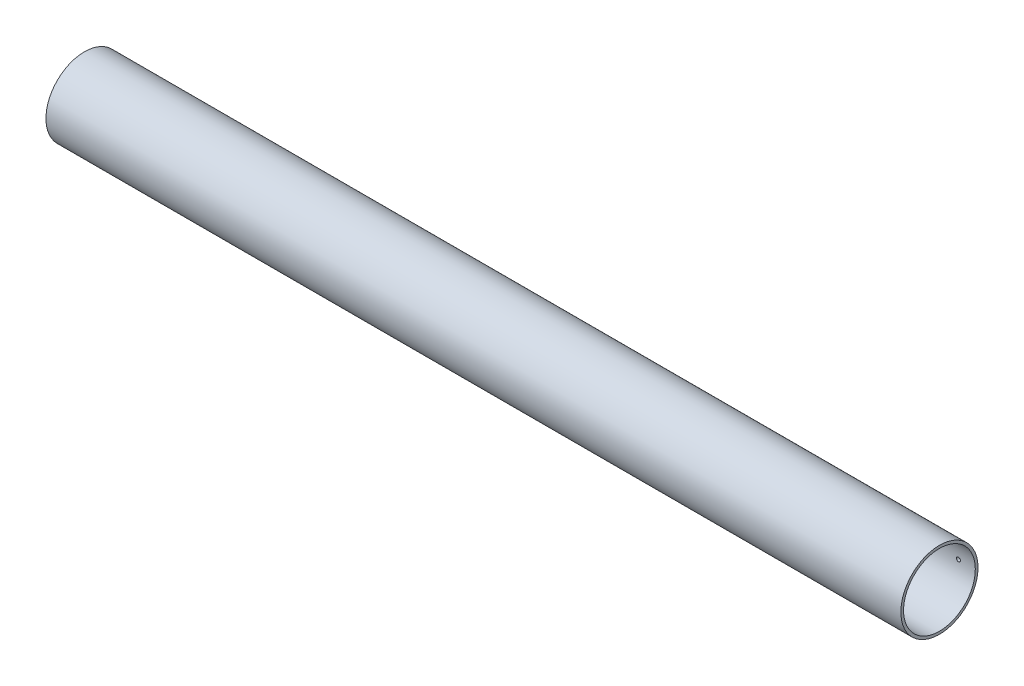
ISO-10303-21;
HEADER;
FILE_DESCRIPTION(('STEP AP214'),'2;1');
FILE_NAME('part.step','',(''),(''),'','','');
FILE_SCHEMA(('AUTOMOTIVE_DESIGN { 1 0 10303 214 1 1 1 1 }'));
ENDSEC;
DATA;
#1=APPLICATION_CONTEXT('core data for automotive mechanical design processes');
#2=APPLICATION_PROTOCOL_DEFINITION('international standard','automotive_design',2000,#1);
#3=PRODUCT_CONTEXT('',#1,'mechanical');
#4=PRODUCT('Part','Part','',(#3));
#5=PRODUCT_RELATED_PRODUCT_CATEGORY('part','',(#4));
#6=PRODUCT_DEFINITION_FORMATION('','',#4);
#7=PRODUCT_DEFINITION_CONTEXT('part definition',#1,'design');
#8=PRODUCT_DEFINITION('design','',#6,#7);
#9=PRODUCT_DEFINITION_SHAPE('','',#8);
#10=(LENGTH_UNIT() NAMED_UNIT(*) SI_UNIT(.MILLI.,.METRE.));
#11=(NAMED_UNIT(*) PLANE_ANGLE_UNIT() SI_UNIT($,.RADIAN.));
#12=(NAMED_UNIT(*) SI_UNIT($,.STERADIAN.) SOLID_ANGLE_UNIT());
#13=UNCERTAINTY_MEASURE_WITH_UNIT(LENGTH_MEASURE(1.E-05),#10,'distance_accuracy_value','');
#14=(GEOMETRIC_REPRESENTATION_CONTEXT(3) GLOBAL_UNCERTAINTY_ASSIGNED_CONTEXT((#13)) GLOBAL_UNIT_ASSIGNED_CONTEXT((#10,
#11,#12)) REPRESENTATION_CONTEXT('',''));
#15=CARTESIAN_POINT('',(0.,0.,0.));
#16=DIRECTION('',(0.,0.,1.));
#17=DIRECTION('',(1.,0.,0.));
#18=AXIS2_PLACEMENT_3D('',#15,#16,#17);
#19=CARTESIAN_POINT('',(644.525,0.,0.));
#20=DIRECTION('',(1.,0.,0.));
#21=DIRECTION('',(0.,0.,-1.));
#22=AXIS2_PLACEMENT_3D('',#19,#20,#21);
#23=PLANE('',#22);
#24=CARTESIAN_POINT('',(644.525,0.,0.));
#25=DIRECTION('',(1.,0.,0.));
#26=DIRECTION('',(0.,0.,-1.));
#27=AXIS2_PLACEMENT_3D('',#24,#25,#26);
#28=CIRCLE('',#27,29.083);
#29=CARTESIAN_POINT('',(644.525,0.,-29.083));
#30=VERTEX_POINT('',#29);
#31=EDGE_CURVE('E10',#30,#30,#28,.T.);
#32=ORIENTED_EDGE('',*,*,#31,.T.);
#33=EDGE_LOOP('',(#32));
#34=FACE_BOUND('',#33,.T.);
#35=CARTESIAN_POINT('',(644.525,0.,0.));
#36=DIRECTION('',(1.,0.,0.));
#37=DIRECTION('',(0.,0.,-1.));
#38=AXIS2_PLACEMENT_3D('',#35,#36,#37);
#39=CIRCLE('',#38,27.051);
#40=CARTESIAN_POINT('',(644.525,0.,-27.051));
#41=VERTEX_POINT('',#40);
#42=EDGE_CURVE('E47',#41,#41,#39,.T.);
#43=ORIENTED_EDGE('',*,*,#42,.F.);
#44=EDGE_LOOP('',(#43));
#45=FACE_BOUND('',#44,.T.);
#46=ADVANCED_FACE('F29',(#34,#45),#23,.T.);
#47=CARTESIAN_POINT('',(0.,0.,0.));
#48=DIRECTION('',(1.,0.,0.));
#49=DIRECTION('',(0.,0.,-1.));
#50=AXIS2_PLACEMENT_3D('',#47,#48,#49);
#51=PLANE('',#50);
#52=CARTESIAN_POINT('',(0.,0.,0.));
#53=DIRECTION('',(1.,0.,0.));
#54=DIRECTION('',(0.,0.,-1.));
#55=AXIS2_PLACEMENT_3D('',#52,#53,#54);
#56=CIRCLE('',#55,29.083);
#57=CARTESIAN_POINT('',(0.,0.,-29.083));
#58=VERTEX_POINT('',#57);
#59=EDGE_CURVE('E42',#58,#58,#56,.T.);
#60=ORIENTED_EDGE('',*,*,#59,.F.);
#61=EDGE_LOOP('',(#60));
#62=FACE_BOUND('',#61,.T.);
#63=CARTESIAN_POINT('',(0.,0.,0.));
#64=DIRECTION('',(1.,0.,0.));
#65=DIRECTION('',(0.,0.,-1.));
#66=AXIS2_PLACEMENT_3D('',#63,#64,#65);
#67=CIRCLE('',#66,27.051);
#68=CARTESIAN_POINT('',(0.,0.,-27.051));
#69=VERTEX_POINT('',#68);
#70=EDGE_CURVE('E73',#69,#69,#67,.T.);
#71=ORIENTED_EDGE('',*,*,#70,.T.);
#72=EDGE_LOOP('',(#71));
#73=FACE_BOUND('',#72,.T.);
#74=ADVANCED_FACE('F83',(#62,#73),#51,.F.);
#75=CARTESIAN_POINT('',(644.525,0.,0.));
#76=DIRECTION('',(-1.,0.,0.));
#77=DIRECTION('',(0.,0.,1.));
#78=AXIS2_PLACEMENT_3D('',#75,#76,#77);
#79=CYLINDRICAL_SURFACE('',#78,29.083);
#80=CARTESIAN_POINT('',(633.349,0.,-29.083));
#81=CARTESIAN_POINT('',(633.34899622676,0.0855407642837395,-29.082999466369));
#82=CARTESIAN_POINT('',(633.341773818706,0.171142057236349,-29.082618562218));
#83=CARTESIAN_POINT('',(633.313064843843,0.339982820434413,-29.0811356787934));
#84=CARTESIAN_POINT('',(633.291561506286,0.423219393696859,-29.0800328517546));
#85=CARTESIAN_POINT('',(633.23490837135,0.58486048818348,-29.0772309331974));
#86=CARTESIAN_POINT('',(633.19976557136,0.663267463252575,-29.0755321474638));
#87=CARTESIAN_POINT('',(633.116841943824,0.813048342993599,-29.0717295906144));
#88=CARTESIAN_POINT('',(633.069064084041,0.884423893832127,-29.069625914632));
#89=CARTESIAN_POINT('',(632.962168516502,1.01821514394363,-29.0652476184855));
#90=CARTESIAN_POINT('',(632.903039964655,1.08062217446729,-29.0629728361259));
#91=CARTESIAN_POINT('',(632.775143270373,1.19463094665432,-29.0585101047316));
#92=CARTESIAN_POINT('',(632.706374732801,1.24623224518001,-29.056322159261));
#93=CARTESIAN_POINT('',(632.561103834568,1.33718933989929,-29.0522786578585));
#94=CARTESIAN_POINT('',(632.484597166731,1.37653826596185,-29.0504232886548));
#95=CARTESIAN_POINT('',(632.326052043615,1.44182959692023,-29.0472561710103));
#96=CARTESIAN_POINT('',(632.244013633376,1.46777211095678,-29.045944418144));
#97=CARTESIAN_POINT('',(632.07681443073,1.50549103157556,-29.0440139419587));
#98=CARTESIAN_POINT('',(631.99165660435,1.51728055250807,-29.0433945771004));
#99=CARTESIAN_POINT('',(631.820568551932,1.52639929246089,-29.0429167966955));
#100=CARTESIAN_POINT('',(631.734638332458,1.52372863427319,-29.0430583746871));
#101=CARTESIAN_POINT('',(631.564533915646,1.50401374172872,-29.0440859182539));
#102=CARTESIAN_POINT('',(631.480358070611,1.48698368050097,-29.0449711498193));
#103=CARTESIAN_POINT('',(631.316061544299,1.43905537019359,-29.0473850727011));
#104=CARTESIAN_POINT('',(631.235940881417,1.40815705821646,-29.0489137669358));
#105=CARTESIAN_POINT('',(631.081983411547,1.33335316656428,-29.0524431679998));
#106=CARTESIAN_POINT('',(631.008149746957,1.28944113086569,-29.0544441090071));
#107=CARTESIAN_POINT('',(630.868896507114,1.18986099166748,-29.058692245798));
#108=CARTESIAN_POINT('',(630.803476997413,1.13419279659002,-29.0609394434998));
#109=CARTESIAN_POINT('',(630.682826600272,1.01260060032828,-29.0654300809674));
#110=CARTESIAN_POINT('',(630.627608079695,0.946664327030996,-29.0676735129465));
#111=CARTESIAN_POINT('',(630.529022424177,0.806450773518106,-29.0719011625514));
#112=CARTESIAN_POINT('',(630.485655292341,0.732173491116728,-29.0738853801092));
#113=CARTESIAN_POINT('',(630.412004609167,0.577379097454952,-29.0773710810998));
#114=CARTESIAN_POINT('',(630.381721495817,0.496861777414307,-29.078872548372));
#115=CARTESIAN_POINT('',(630.335106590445,0.331876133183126,-29.0812233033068));
#116=CARTESIAN_POINT('',(630.318774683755,0.247407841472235,-29.0820725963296));
#117=CARTESIAN_POINT('',(630.300541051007,0.0770253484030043,-29.083022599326));
#118=CARTESIAN_POINT('',(630.298622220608,-0.00888701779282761,-29.083124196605));
#119=CARTESIAN_POINT('',(630.309224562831,-0.179813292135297,-29.0825697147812));
#120=CARTESIAN_POINT('',(630.321745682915,-0.264827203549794,-29.0819136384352));
#121=CARTESIAN_POINT('',(630.360858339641,-0.431495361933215,-29.0799182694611));
#122=CARTESIAN_POINT('',(630.387442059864,-0.513151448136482,-29.0785793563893));
#123=CARTESIAN_POINT('',(630.453917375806,-0.67084271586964,-29.0753690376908));
#124=CARTESIAN_POINT('',(630.493809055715,-0.746877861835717,-29.0734976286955));
#125=CARTESIAN_POINT('',(630.585811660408,-0.891247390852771,-29.0694305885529));
#126=CARTESIAN_POINT('',(630.637934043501,-0.959574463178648,-29.0672346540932));
#127=CARTESIAN_POINT('',(630.752901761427,-1.08651476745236,-29.0627668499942));
#128=CARTESIAN_POINT('',(630.815747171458,-1.14512793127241,-29.0604949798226));
#129=CARTESIAN_POINT('',(630.950450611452,-1.25103425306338,-29.056128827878));
#130=CARTESIAN_POINT('',(631.022317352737,-1.2983163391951,-29.054034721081));
#131=CARTESIAN_POINT('',(631.172979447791,-1.38014265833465,-29.050262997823));
#132=CARTESIAN_POINT('',(631.251774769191,-1.41468695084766,-29.0485853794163));
#133=CARTESIAN_POINT('',(631.414016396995,-1.47003781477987,-29.0458370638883));
#134=CARTESIAN_POINT('',(631.497460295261,-1.49085142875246,-29.0447660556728));
#135=CARTESIAN_POINT('',(631.666664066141,-1.51817314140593,-29.0433508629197));
#136=CARTESIAN_POINT('',(631.752423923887,-1.52468133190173,-29.0430066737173));
#137=CARTESIAN_POINT('',(631.923715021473,-1.5232065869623,-29.043084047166));
#138=CARTESIAN_POINT('',(632.009246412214,-1.51524106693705,-29.0435046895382));
#139=CARTESIAN_POINT('',(632.177755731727,-1.48508103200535,-29.045062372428));
#140=CARTESIAN_POINT('',(632.260733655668,-1.462886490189,-29.0461994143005));
#141=CARTESIAN_POINT('',(632.421784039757,-1.40490206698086,-29.0490615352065));
#142=CARTESIAN_POINT('',(632.499856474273,-1.36911211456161,-29.0507866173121));
#143=CARTESIAN_POINT('',(632.648885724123,-1.28495567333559,-29.0546303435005));
#144=CARTESIAN_POINT('',(632.719842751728,-1.2365895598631,-29.0567489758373));
#145=CARTESIAN_POINT('',(632.852714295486,-1.12859085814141,-29.0611439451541));
#146=CARTESIAN_POINT('',(632.914618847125,-1.06894601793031,-29.0634204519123));
#147=CARTESIAN_POINT('',(633.027556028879,-0.940093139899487,-29.0678733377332));
#148=CARTESIAN_POINT('',(633.078585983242,-0.870882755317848,-29.0700496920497));
#149=CARTESIAN_POINT('',(633.168351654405,-0.724804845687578,-29.0740586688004));
#150=CARTESIAN_POINT('',(633.207074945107,-0.647929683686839,-29.0758909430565));
#151=CARTESIAN_POINT('',(633.271018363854,-0.488816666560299,-29.0790001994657));
#152=CARTESIAN_POINT('',(633.296254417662,-0.406585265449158,-29.0802778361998));
#153=CARTESIAN_POINT('',(633.325898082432,-0.26987025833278,-29.0817964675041));
#154=CARTESIAN_POINT('',(633.334550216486,-0.216271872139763,-29.0822458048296));
#155=CARTESIAN_POINT('',(633.346102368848,-0.108457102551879,-29.0828477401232));
#156=CARTESIAN_POINT('',(633.349002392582,-0.0542407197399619,-29.0830003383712));
#157=CARTESIAN_POINT('',(633.349,0.,-29.083));
#158=B_SPLINE_CURVE_WITH_KNOTS('',3,(#80,#81,#82,#83,#84,#85,#86,#87,#88,#89,#90,#91,#92,#93,
#94,#95,#96,#97,#98,#99,#100,#101,#102,#103,#104,#105,#106,#107,#108,#109,#110,#111,#112,#113,
#114,#115,#116,#117,#118,#119,#120,#121,#122,#123,#124,#125,#126,#127,#128,#129,#130,#131,#132,
#133,#134,#135,#136,#137,#138,#139,#140,#141,#142,#143,#144,#145,#146,#147,#148,#149,#150,#151,
#152,#153,#154,#155,#156,#157),.UNSPECIFIED.,.T.,.F.,(4,2,2,2,2,2,2,2,2,2,2,2,2,2,2,2,2,2,2,2,2,
2,2,2,2,2,2,2,2,2,2,2,2,2,2,2,2,2,4),(0.,0.256424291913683,0.513150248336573,0.769744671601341,
1.02627887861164,1.28305940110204,1.53985045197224,1.79678523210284,2.05371792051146,
2.31041234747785,2.56710459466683,2.82354377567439,3.07998411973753,3.33655189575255,
3.59312167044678,3.8500004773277,4.1068793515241,4.36376682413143,4.62065218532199,
4.87723264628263,5.13381217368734,5.39024923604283,5.64668792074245,5.90336781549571,
6.16004951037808,6.41698100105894,6.67391129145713,6.93070969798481,7.18750645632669,
7.44399443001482,7.70048288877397,7.95697268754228,8.21345483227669,8.47021720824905,
8.72704268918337,8.9841266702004,9.24090641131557,9.40350317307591,9.56609978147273),.UNSPECIFIED.);
#159=CARTESIAN_POINT('',(633.349,0.,-29.083));
#160=VERTEX_POINT('',#159);
#161=EDGE_CURVE('E56',#160,#160,#158,.T.);
#162=ORIENTED_EDGE('',*,*,#161,.T.);
#163=EDGE_LOOP('',(#162));
#164=FACE_BOUND('',#163,.T.);
#165=CARTESIAN_POINT('',(11.684,0.,-29.083));
#166=CARTESIAN_POINT('',(11.6839962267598,0.0855407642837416,-29.082999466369));
#167=CARTESIAN_POINT('',(11.6767738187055,0.171142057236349,-29.082618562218));
#168=CARTESIAN_POINT('',(11.6480648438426,0.339982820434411,-29.0811356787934));
#169=CARTESIAN_POINT('',(11.6265615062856,0.423219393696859,-29.0800328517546));
#170=CARTESIAN_POINT('',(11.5699083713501,0.584860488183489,-29.0772309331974));
#171=CARTESIAN_POINT('',(11.5347655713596,0.663267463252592,-29.0755321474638));
#172=CARTESIAN_POINT('',(11.4518419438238,0.813048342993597,-29.0717295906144));
#173=CARTESIAN_POINT('',(11.404064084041,0.884423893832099,-29.069625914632));
#174=CARTESIAN_POINT('',(11.2971685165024,1.01821514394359,-29.0652476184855));
#175=CARTESIAN_POINT('',(11.238039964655,1.08062217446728,-29.0629728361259));
#176=CARTESIAN_POINT('',(11.1101432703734,1.19463094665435,-29.0585101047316));
#177=CARTESIAN_POINT('',(11.0413747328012,1.24623224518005,-29.056322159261));
#178=CARTESIAN_POINT('',(10.8961038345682,1.33718933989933,-29.0522786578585));
#179=CARTESIAN_POINT('',(10.8195971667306,1.37653826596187,-29.0504232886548));
#180=CARTESIAN_POINT('',(10.6610520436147,1.44182959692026,-29.0472561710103));
#181=CARTESIAN_POINT('',(10.5790136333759,1.46777211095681,-29.045944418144));
#182=CARTESIAN_POINT('',(10.41181443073,1.50549103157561,-29.0440139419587));
#183=CARTESIAN_POINT('',(10.3266566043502,1.51728055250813,-29.0433945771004));
#184=CARTESIAN_POINT('',(10.1555685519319,1.52639929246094,-29.0429167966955));
#185=CARTESIAN_POINT('',(10.0696383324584,1.52372863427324,-29.0430583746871));
#186=CARTESIAN_POINT('',(9.89953391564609,1.50401374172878,-29.0440859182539));
#187=CARTESIAN_POINT('',(9.81535807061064,1.48698368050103,-29.0449711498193));
#188=CARTESIAN_POINT('',(9.65106154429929,1.43905537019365,-29.047385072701));
#189=CARTESIAN_POINT('',(9.57094088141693,1.40815705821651,-29.0489137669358));
#190=CARTESIAN_POINT('',(9.41698341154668,1.33335316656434,-29.0524431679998));
#191=CARTESIAN_POINT('',(9.34314974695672,1.28944113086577,-29.0544441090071));
#192=CARTESIAN_POINT('',(9.20389650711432,1.18986099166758,-29.0586922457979));
#193=CARTESIAN_POINT('',(9.13847699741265,1.13419279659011,-29.0609394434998));
#194=CARTESIAN_POINT('',(9.01782660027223,1.01260060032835,-29.0654300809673));
#195=CARTESIAN_POINT('',(8.96260807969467,0.94666432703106,-29.0676735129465));
#196=CARTESIAN_POINT('',(8.86402242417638,0.806450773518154,-29.0719011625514));
#197=CARTESIAN_POINT('',(8.82065529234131,0.73217349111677,-29.0738853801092));
#198=CARTESIAN_POINT('',(8.74700460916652,0.577379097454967,-29.0773710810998));
#199=CARTESIAN_POINT('',(8.7167214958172,0.496861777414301,-29.078872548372));
#200=CARTESIAN_POINT('',(8.67010659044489,0.331876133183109,-29.0812233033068));
#201=CARTESIAN_POINT('',(8.65377468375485,0.247407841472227,-29.0820725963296));
#202=CARTESIAN_POINT('',(8.63554105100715,0.0770253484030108,-29.083022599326));
#203=CARTESIAN_POINT('',(8.63362222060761,-0.00888701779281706,-29.083124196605));
#204=CARTESIAN_POINT('',(8.64422456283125,-0.179813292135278,-29.0825697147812));
#205=CARTESIAN_POINT('',(8.65674568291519,-0.26482720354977,-29.0819136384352));
#206=CARTESIAN_POINT('',(8.69585833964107,-0.431495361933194,-29.0799182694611));
#207=CARTESIAN_POINT('',(8.72244205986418,-0.513151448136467,-29.0785793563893));
#208=CARTESIAN_POINT('',(8.78891737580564,-0.67084271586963,-29.0753690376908));
#209=CARTESIAN_POINT('',(8.82880905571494,-0.746877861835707,-29.0734976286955));
#210=CARTESIAN_POINT('',(8.92081166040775,-0.891247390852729,-29.0694305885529));
#211=CARTESIAN_POINT('',(8.9729340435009,-0.959574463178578,-29.0672346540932));
#212=CARTESIAN_POINT('',(9.08790176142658,-1.08651476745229,-29.0627668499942));
#213=CARTESIAN_POINT('',(9.150747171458,-1.14512793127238,-29.0604949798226));
#214=CARTESIAN_POINT('',(9.2854506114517,-1.25103425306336,-29.056128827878));
#215=CARTESIAN_POINT('',(9.3573173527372,-1.29831633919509,-29.054034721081));
#216=CARTESIAN_POINT('',(9.50797944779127,-1.38014265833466,-29.050262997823));
#217=CARTESIAN_POINT('',(9.58677476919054,-1.4146869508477,-29.0485853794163));
#218=CARTESIAN_POINT('',(9.74901639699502,-1.4700378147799,-29.0458370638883));
#219=CARTESIAN_POINT('',(9.83246029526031,-1.49085142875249,-29.0447660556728));
#220=CARTESIAN_POINT('',(10.0016640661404,-1.51817314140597,-29.0433508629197));
#221=CARTESIAN_POINT('',(10.0874239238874,-1.52468133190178,-29.0430066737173));
#222=CARTESIAN_POINT('',(10.258715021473,-1.52320658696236,-29.043084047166));
#223=CARTESIAN_POINT('',(10.3442464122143,-1.51524106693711,-29.0435046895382));
#224=CARTESIAN_POINT('',(10.5127557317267,-1.48508103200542,-29.045062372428));
#225=CARTESIAN_POINT('',(10.5957336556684,-1.46288649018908,-29.0461994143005));
#226=CARTESIAN_POINT('',(10.7567840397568,-1.40490206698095,-29.0490615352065));
#227=CARTESIAN_POINT('',(10.8348564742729,-1.3691121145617,-29.0507866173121));
#228=CARTESIAN_POINT('',(10.9838857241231,-1.2849556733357,-29.0546303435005));
#229=CARTESIAN_POINT('',(11.0548427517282,-1.23658955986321,-29.0567489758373));
#230=CARTESIAN_POINT('',(11.1877142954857,-1.12859085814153,-29.0611439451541));
#231=CARTESIAN_POINT('',(11.2496188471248,-1.06894601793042,-29.0634204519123));
#232=CARTESIAN_POINT('',(11.3625560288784,-0.940093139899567,-29.0678733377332));
#233=CARTESIAN_POINT('',(11.4135859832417,-0.8708827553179,-29.0700496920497));
#234=CARTESIAN_POINT('',(11.5033516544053,-0.724804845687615,-29.0740586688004));
#235=CARTESIAN_POINT('',(11.5420749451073,-0.647929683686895,-29.0758909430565));
#236=CARTESIAN_POINT('',(11.6060183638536,-0.488816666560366,-29.0790001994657));
#237=CARTESIAN_POINT('',(11.6312544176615,-0.406585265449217,-29.0802778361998));
#238=CARTESIAN_POINT('',(11.6608980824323,-0.26987025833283,-29.0817964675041));
#239=CARTESIAN_POINT('',(11.6695502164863,-0.216271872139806,-29.0822458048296));
#240=CARTESIAN_POINT('',(11.6811023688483,-0.108457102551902,-29.0828477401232));
#241=CARTESIAN_POINT('',(11.6840023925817,-0.0542407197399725,-29.0830003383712));
#242=CARTESIAN_POINT('',(11.684,0.,-29.083));
#243=B_SPLINE_CURVE_WITH_KNOTS('',3,(#165,#166,#167,#168,#169,#170,#171,#172,#173,#174,#175,
#176,#177,#178,#179,#180,#181,#182,#183,#184,#185,#186,#187,#188,#189,#190,#191,#192,#193,#194,
#195,#196,#197,#198,#199,#200,#201,#202,#203,#204,#205,#206,#207,#208,#209,#210,#211,#212,#213,
#214,#215,#216,#217,#218,#219,#220,#221,#222,#223,#224,#225,#226,#227,#228,#229,#230,#231,#232,
#233,#234,#235,#236,#237,#238,#239,#240,#241,#242),.UNSPECIFIED.,.T.,.F.,(4,2,2,2,2,2,2,2,2,2,2,
2,2,2,2,2,2,2,2,2,2,2,2,2,2,2,2,2,2,2,2,2,2,2,2,2,2,2,4),(0.,0.256424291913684,
0.513150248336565,0.769744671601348,1.02627887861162,1.28305940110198,1.53985045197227,
1.7967852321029,2.05371792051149,2.310412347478,2.56710459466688,2.82354377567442,
3.07998411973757,3.33655189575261,3.5931216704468,3.85000047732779,4.10687935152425,
4.3637668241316,4.62065218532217,4.87723264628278,5.13381217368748,5.390249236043,
5.64668792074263,5.90336781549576,6.16004951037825,6.41698100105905,6.67391129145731,
6.9307096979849,7.18750645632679,7.44399443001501,7.70048288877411,7.95697268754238,
8.21345483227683,8.47021720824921,8.72704268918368,8.98412667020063,9.2409064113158,
9.40350317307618,9.56609978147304),.UNSPECIFIED.);
#244=CARTESIAN_POINT('',(11.684,0.,-29.083));
#245=VERTEX_POINT('',#244);
#246=EDGE_CURVE('E55',#245,#245,#243,.T.);
#247=ORIENTED_EDGE('',*,*,#246,.T.);
#248=EDGE_LOOP('',(#247));
#249=FACE_BOUND('',#248,.T.);
#250=ORIENTED_EDGE('',*,*,#31,.F.);
#251=EDGE_LOOP('',(#250));
#252=FACE_BOUND('',#251,.T.);
#253=ORIENTED_EDGE('',*,*,#59,.T.);
#254=EDGE_LOOP('',(#253));
#255=FACE_BOUND('',#254,.T.);
#256=ADVANCED_FACE('F31',(#164,#249,#252,#255),#79,.T.);
#257=CARTESIAN_POINT('',(644.525,0.,0.));
#258=DIRECTION('',(-1.,0.,0.));
#259=DIRECTION('',(0.,0.,1.));
#260=AXIS2_PLACEMENT_3D('',#257,#258,#259);
#261=CYLINDRICAL_SURFACE('',#260,27.051);
#262=CARTESIAN_POINT('',(633.349,0.,-27.051));
#263=CARTESIAN_POINT('',(633.348996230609,0.0855309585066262,-27.0509994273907));
#264=CARTESIAN_POINT('',(633.341775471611,0.171122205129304,-27.0505900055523));
#265=CARTESIAN_POINT('',(633.313073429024,0.339942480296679,-27.0489961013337));
#266=CARTESIAN_POINT('',(633.291575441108,0.423168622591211,-27.0478107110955));
#267=CARTESIAN_POINT('',(633.23493734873,0.584788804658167,-27.0447990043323));
#268=CARTESIAN_POINT('',(633.1998043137,0.663185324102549,-27.0429730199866));
#269=CARTESIAN_POINT('',(633.116904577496,0.812947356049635,-27.0388856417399));
#270=CARTESIAN_POINT('',(633.069140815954,0.884314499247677,-27.0366243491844));
#271=CARTESIAN_POINT('',(632.962269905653,1.01810159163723,-27.0319174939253));
#272=CARTESIAN_POINT('',(632.903150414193,1.0805116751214,-27.0294717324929));
#273=CARTESIAN_POINT('',(632.775271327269,1.19452881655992,-27.0246732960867));
#274=CARTESIAN_POINT('',(632.706511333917,1.24613542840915,-27.02232062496));
#275=CARTESIAN_POINT('',(632.561248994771,1.33710972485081,-27.0179721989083));
#276=CARTESIAN_POINT('',(632.484741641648,1.37646942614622,-27.0159766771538));
#277=CARTESIAN_POINT('',(632.326191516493,1.44178148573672,-27.0125700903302));
#278=CARTESIAN_POINT('',(632.244148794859,1.46773396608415,-27.0111590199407));
#279=CARTESIAN_POINT('',(632.076950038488,1.50546807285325,-27.0090823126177));
#280=CARTESIAN_POINT('',(631.991797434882,1.51726485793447,-27.0084158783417));
#281=CARTESIAN_POINT('',(631.820718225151,1.52639948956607,-27.0079012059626));
#282=CARTESIAN_POINT('',(631.734791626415,1.52373747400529,-27.0080529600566));
#283=CARTESIAN_POINT('',(631.564706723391,1.50404267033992,-27.0091568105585));
#284=CARTESIAN_POINT('',(631.480546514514,1.48702627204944,-27.0101079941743));
#285=CARTESIAN_POINT('',(631.316278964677,1.43913114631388,-27.0127020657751));
#286=CARTESIAN_POINT('',(631.236171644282,1.40825234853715,-27.0143449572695));
#287=CARTESIAN_POINT('',(631.08223108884,1.33349029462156,-27.0181383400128));
#288=CARTESIAN_POINT('',(631.008401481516,1.28959958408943,-27.020289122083));
#289=CARTESIAN_POINT('',(630.869151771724,1.19006501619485,-27.0248555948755));
#290=CARTESIAN_POINT('',(630.803731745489,1.13442105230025,-27.0272712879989));
#291=CARTESIAN_POINT('',(630.683062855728,1.01286710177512,-27.0320993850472));
#292=CARTESIAN_POINT('',(630.627828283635,0.946942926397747,-27.0345117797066));
#293=CARTESIAN_POINT('',(630.529208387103,0.80674970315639,-27.039058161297));
#294=CARTESIAN_POINT('',(630.485823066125,0.73248065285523,-27.0411921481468));
#295=CARTESIAN_POINT('',(630.412134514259,0.577697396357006,-27.0449413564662));
#296=CARTESIAN_POINT('',(630.381831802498,0.497182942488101,-27.0465565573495));
#297=CARTESIAN_POINT('',(630.335178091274,0.332198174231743,-27.0490858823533));
#298=CARTESIAN_POINT('',(630.318826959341,0.247727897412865,-27.0500000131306));
#299=CARTESIAN_POINT('',(630.300558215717,0.0773533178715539,-27.0510233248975));
#300=CARTESIAN_POINT('',(630.298620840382,-0.00854885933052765,-27.0511336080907));
#301=CARTESIAN_POINT('',(630.309182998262,-0.179457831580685,-27.0505397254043));
#302=CARTESIAN_POINT('',(630.321682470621,-0.264464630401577,-27.0498355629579));
#303=CARTESIAN_POINT('',(630.360747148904,-0.43111429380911,-27.0476927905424));
#304=CARTESIAN_POINT('',(630.387303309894,-0.512759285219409,-27.0462546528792));
#305=CARTESIAN_POINT('',(630.45371835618,-0.670433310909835,-27.0428057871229));
#306=CARTESIAN_POINT('',(630.493577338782,-0.746462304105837,-27.0407950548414));
#307=CARTESIAN_POINT('',(630.585517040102,-0.8908367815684,-27.036424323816));
#308=CARTESIAN_POINT('',(630.637610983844,-0.959173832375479,-27.0340639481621));
#309=CARTESIAN_POINT('',(630.752522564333,-1.0861397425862,-27.0292609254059));
#310=CARTESIAN_POINT('',(630.815340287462,-1.14476852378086,-27.026818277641));
#311=CARTESIAN_POINT('',(630.950001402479,-1.25072037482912,-27.0221228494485));
#312=CARTESIAN_POINT('',(631.021854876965,-1.29803064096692,-27.0198702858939));
#313=CARTESIAN_POINT('',(631.172497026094,-1.37991495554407,-27.0158124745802));
#314=CARTESIAN_POINT('',(631.251285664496,-1.41448907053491,-27.0140072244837));
#315=CARTESIAN_POINT('',(631.413514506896,-1.46989739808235,-27.0110491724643));
#316=CARTESIAN_POINT('',(631.4969519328,-1.49073972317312,-27.0098959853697));
#317=CARTESIAN_POINT('',(631.666148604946,-1.51811934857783,-27.0083710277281));
#318=CARTESIAN_POINT('',(631.751907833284,-1.52465675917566,-27.0079992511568));
#319=CARTESIAN_POINT('',(631.92318634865,-1.52323994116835,-27.0080791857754));
#320=CARTESIAN_POINT('',(632.008705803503,-1.51530584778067,-27.0085297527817));
#321=CARTESIAN_POINT('',(632.177196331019,-1.48521292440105,-27.0102011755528));
#322=CARTESIAN_POINT('',(632.260167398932,-1.4630540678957,-27.0114220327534));
#323=CARTESIAN_POINT('',(632.42120950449,-1.40514496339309,-27.0144961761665));
#324=CARTESIAN_POINT('',(632.499280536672,-1.36939470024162,-27.0163494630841));
#325=CARTESIAN_POINT('',(632.648314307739,-1.28532066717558,-27.0204795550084));
#326=CARTESIAN_POINT('',(632.719277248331,-1.23699725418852,-27.0227563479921));
#327=CARTESIAN_POINT('',(632.852181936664,-1.12907514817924,-27.0274805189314));
#328=CARTESIAN_POINT('',(632.914112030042,-1.06946211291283,-27.0299281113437));
#329=CARTESIAN_POINT('',(633.027105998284,-0.940668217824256,-27.0347163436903));
#330=CARTESIAN_POINT('',(633.078167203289,-0.871485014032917,-27.0370569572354));
#331=CARTESIAN_POINT('',(633.168004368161,-0.725448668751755,-27.0413694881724));
#332=CARTESIAN_POINT('',(633.206766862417,-0.648587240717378,-27.0433410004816));
#333=CARTESIAN_POINT('',(633.270789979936,-0.489492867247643,-27.0466874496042));
#334=CARTESIAN_POINT('',(633.296066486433,-0.407266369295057,-27.0480630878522));
#335=CARTESIAN_POINT('',(633.325799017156,-0.270443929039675,-27.0497005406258));
#336=CARTESIAN_POINT('',(633.334488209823,-0.216733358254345,-27.0501856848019));
#337=CARTESIAN_POINT('',(633.346089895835,-0.108689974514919,-27.0508355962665));
#338=CARTESIAN_POINT('',(633.349002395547,-0.0543571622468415,-27.0510003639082));
#339=CARTESIAN_POINT('',(633.349,0.,-27.051));
#340=B_SPLINE_CURVE_WITH_KNOTS('',3,(#262,#263,#264,#265,#266,#267,#268,#269,#270,#271,#272,
#273,#274,#275,#276,#277,#278,#279,#280,#281,#282,#283,#284,#285,#286,#287,#288,#289,#290,#291,
#292,#293,#294,#295,#296,#297,#298,#299,#300,#301,#302,#303,#304,#305,#306,#307,#308,#309,#310,
#311,#312,#313,#314,#315,#316,#317,#318,#319,#320,#321,#322,#323,#324,#325,#326,#327,#328,#329,
#330,#331,#332,#333,#334,#335,#336,#337,#338,#339),.UNSPECIFIED.,.T.,.F.,(4,2,2,2,2,2,2,2,2,2,2,
2,2,2,2,2,2,2,2,2,2,2,2,2,2,2,2,2,2,2,2,2,2,2,2,2,2,2,4),(0.,0.256394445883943,
0.513089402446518,0.769651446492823,1.02615383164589,1.28293660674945,1.53972998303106,
1.79669040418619,2.05364848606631,2.31033115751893,2.56701138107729,2.82339892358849,
3.0797877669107,3.33632377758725,3.59286211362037,3.84975770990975,4.10665338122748,
4.36355924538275,4.62046267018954,4.87701377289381,5.13356379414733,5.38994893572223,
5.64633595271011,5.90300138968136,6.15966889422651,6.41662538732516,6.6735805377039,
6.930383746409,7.18718497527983,7.44362917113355,7.70007384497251,7.95651880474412,
8.21295648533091,8.46972215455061,8.72655082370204,8.98365972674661,9.24046514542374,
9.40341070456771,9.56635608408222),.UNSPECIFIED.);
#341=CARTESIAN_POINT('',(633.349,0.,-27.051));
#342=VERTEX_POINT('',#341);
#343=EDGE_CURVE('E34',#342,#342,#340,.T.);
#344=ORIENTED_EDGE('',*,*,#343,.F.);
#345=EDGE_LOOP('',(#344));
#346=FACE_BOUND('',#345,.T.);
#347=CARTESIAN_POINT('',(11.684,0.,-27.051));
#348=CARTESIAN_POINT('',(11.6839962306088,0.0855309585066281,-27.0509994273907));
#349=CARTESIAN_POINT('',(11.6767754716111,0.171122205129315,-27.0505900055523));
#350=CARTESIAN_POINT('',(11.6480734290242,0.339942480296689,-27.0489961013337));
#351=CARTESIAN_POINT('',(11.6265754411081,0.423168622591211,-27.0478107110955));
#352=CARTESIAN_POINT('',(11.5699373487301,0.584788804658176,-27.0447990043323));
#353=CARTESIAN_POINT('',(11.5348043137,0.663185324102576,-27.0429730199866));
#354=CARTESIAN_POINT('',(11.4519045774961,0.812947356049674,-27.0388856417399));
#355=CARTESIAN_POINT('',(11.404140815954,0.884314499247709,-27.0366243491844));
#356=CARTESIAN_POINT('',(11.2972699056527,1.01810159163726,-27.0319174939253));
#357=CARTESIAN_POINT('',(11.238150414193,1.08051167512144,-27.0294717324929));
#358=CARTESIAN_POINT('',(11.1102713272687,1.19452881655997,-27.0246732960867));
#359=CARTESIAN_POINT('',(11.0415113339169,1.2461354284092,-27.02232062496));
#360=CARTESIAN_POINT('',(10.8962489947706,1.33710972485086,-27.0179721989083));
#361=CARTESIAN_POINT('',(10.8197416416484,1.37646942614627,-27.0159766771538));
#362=CARTESIAN_POINT('',(10.6611915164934,1.44178148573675,-27.0125700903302));
#363=CARTESIAN_POINT('',(10.5791487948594,1.46773396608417,-27.0111590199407));
#364=CARTESIAN_POINT('',(10.4119500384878,1.50546807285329,-27.0090823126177));
#365=CARTESIAN_POINT('',(10.3267974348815,1.51726485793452,-27.0084158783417));
#366=CARTESIAN_POINT('',(10.1557182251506,1.52639948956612,-27.0079012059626));
#367=CARTESIAN_POINT('',(10.0697916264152,1.52373747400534,-27.0080529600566));
#368=CARTESIAN_POINT('',(9.89970672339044,1.50404267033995,-27.0091568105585));
#369=CARTESIAN_POINT('',(9.81554651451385,1.48702627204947,-27.0101079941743));
#370=CARTESIAN_POINT('',(9.65127896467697,1.4391311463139,-27.0127020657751));
#371=CARTESIAN_POINT('',(9.57117164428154,1.40825234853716,-27.0143449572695));
#372=CARTESIAN_POINT('',(9.41723108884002,1.33349029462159,-27.0181383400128));
#373=CARTESIAN_POINT('',(9.34340148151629,1.28959958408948,-27.020289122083));
#374=CARTESIAN_POINT('',(9.20415177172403,1.19006501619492,-27.0248555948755));
#375=CARTESIAN_POINT('',(9.13873174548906,1.13442105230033,-27.0272712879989));
#376=CARTESIAN_POINT('',(9.01806285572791,1.01286710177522,-27.0320993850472));
#377=CARTESIAN_POINT('',(8.96282828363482,0.946942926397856,-27.0345117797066));
#378=CARTESIAN_POINT('',(8.86420838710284,0.806749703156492,-27.039058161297));
#379=CARTESIAN_POINT('',(8.82082306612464,0.732480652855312,-27.0411921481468));
#380=CARTESIAN_POINT('',(8.74713451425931,0.577697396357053,-27.0449413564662));
#381=CARTESIAN_POINT('',(8.71683180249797,0.497182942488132,-27.0465565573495));
#382=CARTESIAN_POINT('',(8.67017809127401,0.332198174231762,-27.0490858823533));
#383=CARTESIAN_POINT('',(8.65382695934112,0.247727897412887,-27.0500000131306));
#384=CARTESIAN_POINT('',(8.63555821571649,0.0773533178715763,-27.0510233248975));
#385=CARTESIAN_POINT('',(8.63362084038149,-0.00854885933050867,-27.0511336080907));
#386=CARTESIAN_POINT('',(8.64418299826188,-0.179457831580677,-27.0505397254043));
#387=CARTESIAN_POINT('',(8.65668247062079,-0.264464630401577,-27.0498355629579));
#388=CARTESIAN_POINT('',(8.69574714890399,-0.431114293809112,-27.0476927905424));
#389=CARTESIAN_POINT('',(8.72230330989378,-0.512759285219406,-27.0462546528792));
#390=CARTESIAN_POINT('',(8.78871835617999,-0.670433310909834,-27.0428057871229));
#391=CARTESIAN_POINT('',(8.82857733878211,-0.746462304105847,-27.0407950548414));
#392=CARTESIAN_POINT('',(8.92051704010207,-0.890836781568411,-27.036424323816));
#393=CARTESIAN_POINT('',(8.97261098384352,-0.959173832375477,-27.0340639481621));
#394=CARTESIAN_POINT('',(9.08752256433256,-1.08613974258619,-27.0292609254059));
#395=CARTESIAN_POINT('',(9.15034028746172,-1.14476852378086,-27.026818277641));
#396=CARTESIAN_POINT('',(9.28500140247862,-1.25072037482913,-27.0221228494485));
#397=CARTESIAN_POINT('',(9.3568548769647,-1.29803064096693,-27.0198702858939));
#398=CARTESIAN_POINT('',(9.5074970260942,-1.37991495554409,-27.0158124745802));
#399=CARTESIAN_POINT('',(9.58628566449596,-1.41448907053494,-27.0140072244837));
#400=CARTESIAN_POINT('',(9.74851450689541,-1.46989739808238,-27.0110491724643));
#401=CARTESIAN_POINT('',(9.83195193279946,-1.49073972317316,-27.0098959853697));
#402=CARTESIAN_POINT('',(10.0011486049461,-1.51811934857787,-27.0083710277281));
#403=CARTESIAN_POINT('',(10.0869078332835,-1.5246567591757,-27.0079992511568));
#404=CARTESIAN_POINT('',(10.25818634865,-1.5232399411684,-27.0080791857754));
#405=CARTESIAN_POINT('',(10.3437058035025,-1.51530584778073,-27.0085297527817));
#406=CARTESIAN_POINT('',(10.5121963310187,-1.48521292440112,-27.0102011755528));
#407=CARTESIAN_POINT('',(10.5951673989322,-1.46305406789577,-27.0114220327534));
#408=CARTESIAN_POINT('',(10.7562095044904,-1.40514496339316,-27.0144961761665));
#409=CARTESIAN_POINT('',(10.8342805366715,-1.36939470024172,-27.0163494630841));
#410=CARTESIAN_POINT('',(10.9833143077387,-1.28532066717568,-27.0204795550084));
#411=CARTESIAN_POINT('',(11.0542772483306,-1.2369972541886,-27.0227563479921));
#412=CARTESIAN_POINT('',(11.1871819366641,-1.1290751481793,-27.0274805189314));
#413=CARTESIAN_POINT('',(11.2491120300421,-1.06946211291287,-27.0299281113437));
#414=CARTESIAN_POINT('',(11.3621059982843,-0.940668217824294,-27.0347163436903));
#415=CARTESIAN_POINT('',(11.4131672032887,-0.871485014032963,-27.0370569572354));
#416=CARTESIAN_POINT('',(11.5030043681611,-0.725448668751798,-27.0413694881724));
#417=CARTESIAN_POINT('',(11.5417668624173,-0.64858724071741,-27.0433410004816));
#418=CARTESIAN_POINT('',(11.6057899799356,-0.489492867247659,-27.0466874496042));
#419=CARTESIAN_POINT('',(11.6310664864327,-0.407266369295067,-27.0480630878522));
#420=CARTESIAN_POINT('',(11.6607990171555,-0.270443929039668,-27.0497005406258));
#421=CARTESIAN_POINT('',(11.6694882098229,-0.216733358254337,-27.0501856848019));
#422=CARTESIAN_POINT('',(11.6810898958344,-0.108689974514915,-27.0508355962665));
#423=CARTESIAN_POINT('',(11.6840023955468,-0.0543571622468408,-27.0510003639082));
#424=CARTESIAN_POINT('',(11.684,0.,-27.051));
#425=B_SPLINE_CURVE_WITH_KNOTS('',3,(#347,#348,#349,#350,#351,#352,#353,#354,#355,#356,#357,
#358,#359,#360,#361,#362,#363,#364,#365,#366,#367,#368,#369,#370,#371,#372,#373,#374,#375,#376,
#377,#378,#379,#380,#381,#382,#383,#384,#385,#386,#387,#388,#389,#390,#391,#392,#393,#394,#395,
#396,#397,#398,#399,#400,#401,#402,#403,#404,#405,#406,#407,#408,#409,#410,#411,#412,#413,#414,
#415,#416,#417,#418,#419,#420,#421,#422,#423,#424),.UNSPECIFIED.,.T.,.F.,(4,2,2,2,2,2,2,2,2,2,2,
2,2,2,2,2,2,2,2,2,2,2,2,2,2,2,2,2,2,2,2,2,2,2,2,2,2,2,4),(0.,0.256394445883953,
0.513089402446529,0.769651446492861,1.02615383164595,1.2829366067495,1.53972998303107,
1.79669040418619,2.05364848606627,2.31033115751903,2.56701138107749,2.82339892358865,
3.07978776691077,3.33632377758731,3.59286211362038,3.84975770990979,4.10665338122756,
4.36355924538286,4.62046267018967,4.87701377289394,5.13356379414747,5.3899489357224,
5.64633595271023,5.90300138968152,6.15966889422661,6.41662538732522,6.67358053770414,
6.9303837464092,7.18718497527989,7.44362917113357,7.70007384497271,7.95651880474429,
8.21295648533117,8.46972215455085,8.7265508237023,8.98365972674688,9.24046514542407,
9.40341070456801,9.56635608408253),.UNSPECIFIED.);
#426=CARTESIAN_POINT('',(11.684,0.,-27.051));
#427=VERTEX_POINT('',#426);
#428=EDGE_CURVE('E50',#427,#427,#425,.T.);
#429=ORIENTED_EDGE('',*,*,#428,.F.);
#430=EDGE_LOOP('',(#429));
#431=FACE_BOUND('',#430,.T.);
#432=ORIENTED_EDGE('',*,*,#42,.T.);
#433=EDGE_LOOP('',(#432));
#434=FACE_BOUND('',#433,.T.);
#435=ORIENTED_EDGE('',*,*,#70,.F.);
#436=EDGE_LOOP('',(#435));
#437=FACE_BOUND('',#436,.T.);
#438=ADVANCED_FACE('F57',(#346,#431,#434,#437),#261,.F.);
#439=CARTESIAN_POINT('',(10.16,0.,-29.083));
#440=DIRECTION('',(0.,0.,1.));
#441=DIRECTION('',(1.,0.,0.));
#442=AXIS2_PLACEMENT_3D('',#439,#440,#441);
#443=CYLINDRICAL_SURFACE('',#442,1.524);
#444=ORIENTED_EDGE('',*,*,#428,.T.);
#445=EDGE_LOOP('',(#444));
#446=FACE_BOUND('',#445,.T.);
#447=ORIENTED_EDGE('',*,*,#246,.F.);
#448=EDGE_LOOP('',(#447));
#449=FACE_BOUND('',#448,.T.);
#450=ADVANCED_FACE('F60',(#446,#449),#443,.F.);
#451=CARTESIAN_POINT('',(631.825,0.,-29.083));
#452=DIRECTION('',(0.,0.,1.));
#453=DIRECTION('',(1.,0.,0.));
#454=AXIS2_PLACEMENT_3D('',#451,#452,#453);
#455=CYLINDRICAL_SURFACE('',#454,1.52399999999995);
#456=ORIENTED_EDGE('',*,*,#343,.T.);
#457=EDGE_LOOP('',(#456));
#458=FACE_BOUND('',#457,.T.);
#459=ORIENTED_EDGE('',*,*,#161,.F.);
#460=EDGE_LOOP('',(#459));
#461=FACE_BOUND('',#460,.T.);
#462=ADVANCED_FACE('F63',(#458,#461),#455,.F.);
#463=CLOSED_SHELL('',(#46,#74,#256,#438,#450,#462));
#464=MANIFOLD_SOLID_BREP('B2',#463);
#465=ADVANCED_BREP_SHAPE_REPRESENTATION('',(#18,#464),#14);
#466=SHAPE_DEFINITION_REPRESENTATION(#9,#465);
ENDSEC;
END-ISO-10303-21;
